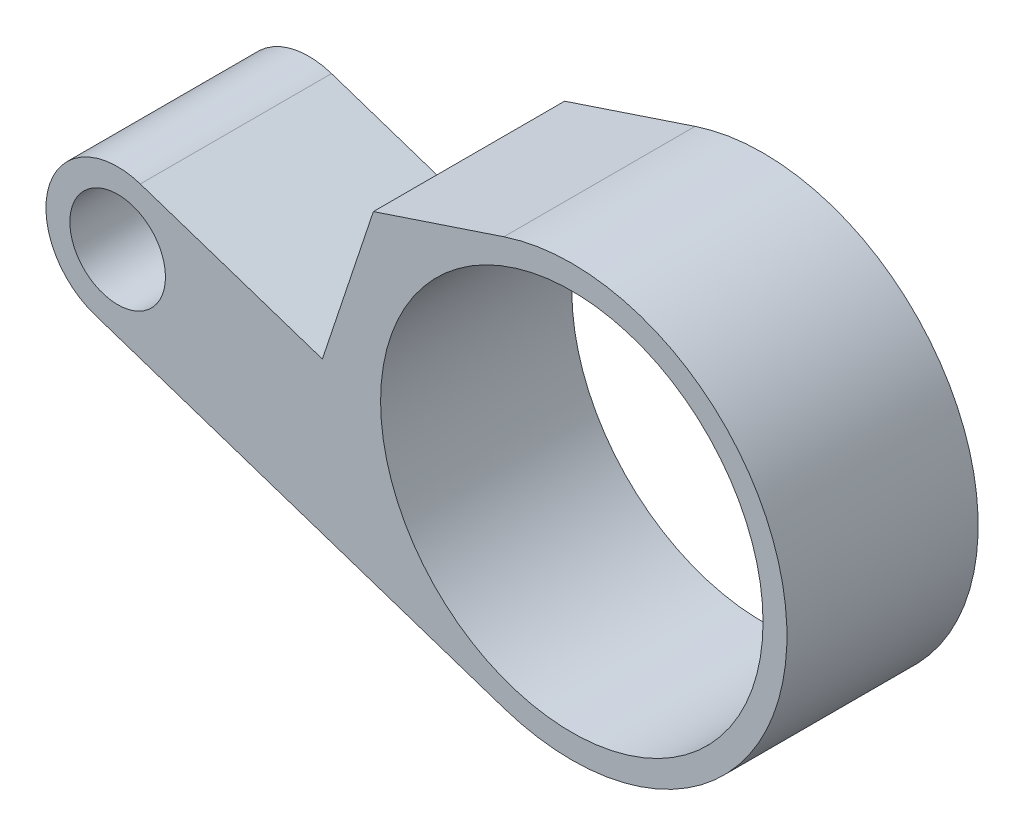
ISO-10303-21;
HEADER;
FILE_DESCRIPTION(('STEP AP214'),'2;1');
FILE_NAME('part.step','',(''),(''),'','','');
FILE_SCHEMA(('AUTOMOTIVE_DESIGN { 1 0 10303 214 1 1 1 1 }'));
ENDSEC;
DATA;
#1=APPLICATION_CONTEXT('core data for automotive mechanical design processes');
#2=APPLICATION_PROTOCOL_DEFINITION('international standard','automotive_design',2000,#1);
#3=PRODUCT_CONTEXT('',#1,'mechanical');
#4=PRODUCT('Part','Part','',(#3));
#5=PRODUCT_RELATED_PRODUCT_CATEGORY('part','',(#4));
#6=PRODUCT_DEFINITION_FORMATION('','',#4);
#7=PRODUCT_DEFINITION_CONTEXT('part definition',#1,'design');
#8=PRODUCT_DEFINITION('design','',#6,#7);
#9=PRODUCT_DEFINITION_SHAPE('','',#8);
#10=(LENGTH_UNIT() NAMED_UNIT(*) SI_UNIT(.MILLI.,.METRE.));
#11=(NAMED_UNIT(*) PLANE_ANGLE_UNIT() SI_UNIT($,.RADIAN.));
#12=(NAMED_UNIT(*) SI_UNIT($,.STERADIAN.) SOLID_ANGLE_UNIT());
#13=UNCERTAINTY_MEASURE_WITH_UNIT(LENGTH_MEASURE(1.E-05),#10,'distance_accuracy_value','');
#14=(GEOMETRIC_REPRESENTATION_CONTEXT(3) GLOBAL_UNCERTAINTY_ASSIGNED_CONTEXT((#13)) GLOBAL_UNIT_ASSIGNED_CONTEXT((#10,
#11,#12)) REPRESENTATION_CONTEXT('',''));
#15=CARTESIAN_POINT('',(0.,0.,0.));
#16=DIRECTION('',(0.,0.,1.));
#17=DIRECTION('',(1.,0.,0.));
#18=AXIS2_PLACEMENT_3D('',#15,#16,#17);
#19=CARTESIAN_POINT('',(-60.325,0.,25.4));
#20=DIRECTION('',(0.,0.,1.));
#21=DIRECTION('',(1.,0.,0.));
#22=AXIS2_PLACEMENT_3D('',#19,#20,#21);
#23=PLANE('',#22);
#24=CARTESIAN_POINT('',(0.,0.,25.4));
#25=DIRECTION('',(0.,0.,1.));
#26=DIRECTION('',(1.,0.,0.));
#27=AXIS2_PLACEMENT_3D('',#24,#25,#26);
#28=CIRCLE('',#27,25.4);
#29=CARTESIAN_POINT('',(25.4,0.,25.4));
#30=VERTEX_POINT('',#29);
#31=EDGE_CURVE('E124',#30,#30,#28,.T.);
#32=ORIENTED_EDGE('',*,*,#31,.F.);
#33=EDGE_LOOP('',(#32));
#34=FACE_BOUND('',#33,.T.);
#35=DIRECTION('',(-0.31578947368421,-0.948829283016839,0.));
#36=VECTOR('',#35,1.);
#37=CARTESIAN_POINT('',(-26.3588028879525,21.3433205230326,25.4));
#38=LINE('',#37,#36);
#39=CARTESIAN_POINT('',(-26.3588028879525,21.3433205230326,25.4));
#40=VERTEX_POINT('',#39);
#41=CARTESIAN_POINT('',(-33.1332244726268,0.988716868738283,25.4));
#42=VERTEX_POINT('',#41);
#43=EDGE_CURVE('E131',#40,#42,#38,.T.);
#44=ORIENTED_EDGE('',*,*,#43,.T.);
#45=DIRECTION('',(-0.948829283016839,0.315789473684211,0.));
#46=VECTOR('',#45,1.);
#47=CARTESIAN_POINT('',(-33.1332244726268,0.988716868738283,25.4));
#48=LINE('',#47,#46);
#49=CARTESIAN_POINT('',(-57.3171052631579,9.03759892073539,25.4));
#50=VERTEX_POINT('',#49);
#51=EDGE_CURVE('E89',#42,#50,#48,.T.);
#52=ORIENTED_EDGE('',*,*,#51,.T.);
#53=CARTESIAN_POINT('',(-60.325,0.,25.4));
#54=DIRECTION('',(0.,0.,1.));
#55=DIRECTION('',(1.,0.,0.));
#56=AXIS2_PLACEMENT_3D('',#53,#54,#55);
#57=CIRCLE('',#56,9.525);
#58=CARTESIAN_POINT('',(-63.3328947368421,-9.0375989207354,25.4));
#59=VERTEX_POINT('',#58);
#60=EDGE_CURVE('E102',#50,#59,#57,.T.);
#61=ORIENTED_EDGE('',*,*,#60,.T.);
#62=DIRECTION('',(0.948829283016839,-0.315789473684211,0.));
#63=VECTOR('',#62,1.);
#64=CARTESIAN_POINT('',(-63.3328947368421,-9.0375989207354,25.4));
#65=LINE('',#64,#63);
#66=CARTESIAN_POINT('',(-9.02368421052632,-27.1127967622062,25.4));
#67=VERTEX_POINT('',#66);
#68=EDGE_CURVE('E96',#59,#67,#65,.T.);
#69=ORIENTED_EDGE('',*,*,#68,.T.);
#70=CARTESIAN_POINT('',(0.,0.,25.4));
#71=DIRECTION('',(0.,0.,1.));
#72=DIRECTION('',(1.,0.,0.));
#73=AXIS2_PLACEMENT_3D('',#70,#71,#72);
#74=CIRCLE('',#73,28.575);
#75=CARTESIAN_POINT('',(-9.02368421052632,27.1127967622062,25.4));
#76=VERTEX_POINT('',#75);
#77=EDGE_CURVE('E100',#67,#76,#74,.T.);
#78=ORIENTED_EDGE('',*,*,#77,.T.);
#79=DIRECTION('',(-0.948829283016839,-0.315789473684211,0.));
#80=VECTOR('',#79,1.);
#81=CARTESIAN_POINT('',(-26.3588028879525,21.3433205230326,25.4));
#82=LINE('',#81,#80);
#83=EDGE_CURVE('E52',#76,#40,#82,.T.);
#84=ORIENTED_EDGE('',*,*,#83,.T.);
#85=EDGE_LOOP('',(#44,#52,#61,#69,#78,#84));
#86=FACE_BOUND('',#85,.T.);
#87=CARTESIAN_POINT('',(-60.325,0.,25.4));
#88=DIRECTION('',(0.,0.,1.));
#89=DIRECTION('',(1.,0.,0.));
#90=AXIS2_PLACEMENT_3D('',#87,#88,#89);
#91=CIRCLE('',#90,6.35);
#92=CARTESIAN_POINT('',(-53.975,0.,25.4));
#93=VERTEX_POINT('',#92);
#94=EDGE_CURVE('E174',#93,#93,#91,.T.);
#95=ORIENTED_EDGE('',*,*,#94,.F.);
#96=EDGE_LOOP('',(#95));
#97=FACE_BOUND('',#96,.T.);
#98=ADVANCED_FACE('F35',(#34,#86,#97),#23,.T.);
#99=CARTESIAN_POINT('',(-60.325,0.,0.));
#100=DIRECTION('',(0.,0.,1.));
#101=DIRECTION('',(1.,0.,0.));
#102=AXIS2_PLACEMENT_3D('',#99,#100,#101);
#103=PLANE('',#102);
#104=CARTESIAN_POINT('',(0.,0.,0.));
#105=DIRECTION('',(0.,0.,1.));
#106=DIRECTION('',(1.,0.,0.));
#107=AXIS2_PLACEMENT_3D('',#104,#105,#106);
#108=CIRCLE('',#107,25.4);
#109=CARTESIAN_POINT('',(25.4,0.,0.));
#110=VERTEX_POINT('',#109);
#111=EDGE_CURVE('E179',#110,#110,#108,.T.);
#112=ORIENTED_EDGE('',*,*,#111,.T.);
#113=EDGE_LOOP('',(#112));
#114=FACE_BOUND('',#113,.T.);
#115=DIRECTION('',(-0.31578947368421,-0.948829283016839,0.));
#116=VECTOR('',#115,1.);
#117=CARTESIAN_POINT('',(-26.3588028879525,21.3433205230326,0.));
#118=LINE('',#117,#116);
#119=CARTESIAN_POINT('',(-26.3588028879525,21.3433205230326,0.));
#120=VERTEX_POINT('',#119);
#121=CARTESIAN_POINT('',(-33.1332244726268,0.988716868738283,0.));
#122=VERTEX_POINT('',#121);
#123=EDGE_CURVE('E120',#120,#122,#118,.T.);
#124=ORIENTED_EDGE('',*,*,#123,.F.);
#125=DIRECTION('',(-0.948829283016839,-0.315789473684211,0.));
#126=VECTOR('',#125,1.);
#127=CARTESIAN_POINT('',(-26.3588028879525,21.3433205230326,0.));
#128=LINE('',#127,#126);
#129=CARTESIAN_POINT('',(-9.02368421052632,27.1127967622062,0.));
#130=VERTEX_POINT('',#129);
#131=EDGE_CURVE('E81',#130,#120,#128,.T.);
#132=ORIENTED_EDGE('',*,*,#131,.F.);
#133=CARTESIAN_POINT('',(0.,0.,0.));
#134=DIRECTION('',(0.,0.,1.));
#135=DIRECTION('',(1.,0.,0.));
#136=AXIS2_PLACEMENT_3D('',#133,#134,#135);
#137=CIRCLE('',#136,28.575);
#138=CARTESIAN_POINT('',(-9.02368421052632,-27.1127967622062,0.));
#139=VERTEX_POINT('',#138);
#140=EDGE_CURVE('E75',#139,#130,#137,.T.);
#141=ORIENTED_EDGE('',*,*,#140,.F.);
#142=DIRECTION('',(0.948829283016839,-0.315789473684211,0.));
#143=VECTOR('',#142,1.);
#144=CARTESIAN_POINT('',(-63.3328947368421,-9.0375989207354,0.));
#145=LINE('',#144,#143);
#146=CARTESIAN_POINT('',(-63.3328947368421,-9.0375989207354,0.));
#147=VERTEX_POINT('',#146);
#148=EDGE_CURVE('E110',#147,#139,#145,.T.);
#149=ORIENTED_EDGE('',*,*,#148,.F.);
#150=CARTESIAN_POINT('',(-60.325,0.,0.));
#151=DIRECTION('',(0.,0.,1.));
#152=DIRECTION('',(1.,0.,0.));
#153=AXIS2_PLACEMENT_3D('',#150,#151,#152);
#154=CIRCLE('',#153,9.525);
#155=CARTESIAN_POINT('',(-57.3171052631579,9.03759892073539,0.));
#156=VERTEX_POINT('',#155);
#157=EDGE_CURVE('E126',#156,#147,#154,.T.);
#158=ORIENTED_EDGE('',*,*,#157,.F.);
#159=DIRECTION('',(-0.948829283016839,0.315789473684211,0.));
#160=VECTOR('',#159,1.);
#161=CARTESIAN_POINT('',(-33.1332244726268,0.988716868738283,0.));
#162=LINE('',#161,#160);
#163=EDGE_CURVE('E123',#122,#156,#162,.T.);
#164=ORIENTED_EDGE('',*,*,#163,.F.);
#165=EDGE_LOOP('',(#124,#132,#141,#149,#158,#164));
#166=FACE_BOUND('',#165,.T.);
#167=CARTESIAN_POINT('',(-60.325,0.,0.));
#168=DIRECTION('',(0.,0.,1.));
#169=DIRECTION('',(1.,0.,0.));
#170=AXIS2_PLACEMENT_3D('',#167,#168,#169);
#171=CIRCLE('',#170,6.35);
#172=CARTESIAN_POINT('',(-53.975,0.,0.));
#173=VERTEX_POINT('',#172);
#174=EDGE_CURVE('E177',#173,#173,#171,.T.);
#175=ORIENTED_EDGE('',*,*,#174,.T.);
#176=EDGE_LOOP('',(#175));
#177=FACE_BOUND('',#176,.T.);
#178=ADVANCED_FACE('F140',(#114,#166,#177),#103,.F.);
#179=CARTESIAN_POINT('',(-26.3588028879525,21.3433205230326,25.4));
#180=DIRECTION('',(0.948829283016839,-0.31578947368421,0.));
#181=DIRECTION('',(0.31578947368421,0.948829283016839,0.));
#182=AXIS2_PLACEMENT_3D('',#179,#180,#181);
#183=PLANE('',#182);
#184=ORIENTED_EDGE('',*,*,#123,.T.);
#185=DIRECTION('',(0.,0.,-1.));
#186=VECTOR('',#185,1.);
#187=CARTESIAN_POINT('',(-33.1332244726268,0.988716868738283,25.4));
#188=LINE('',#187,#186);
#189=EDGE_CURVE('E11',#42,#122,#188,.T.);
#190=ORIENTED_EDGE('',*,*,#189,.F.);
#191=ORIENTED_EDGE('',*,*,#43,.F.);
#192=DIRECTION('',(0.,0.,-1.));
#193=VECTOR('',#192,1.);
#194=CARTESIAN_POINT('',(-26.3588028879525,21.3433205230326,25.4));
#195=LINE('',#194,#193);
#196=EDGE_CURVE('E116',#40,#120,#195,.T.);
#197=ORIENTED_EDGE('',*,*,#196,.T.);
#198=EDGE_LOOP('',(#184,#190,#191,#197));
#199=FACE_BOUND('',#198,.T.);
#200=ADVANCED_FACE('F37',(#199),#183,.F.);
#201=CARTESIAN_POINT('',(-33.1332244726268,0.988716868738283,25.4));
#202=DIRECTION('',(-0.315789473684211,-0.948829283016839,0.));
#203=DIRECTION('',(0.948829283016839,-0.315789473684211,0.));
#204=AXIS2_PLACEMENT_3D('',#201,#202,#203);
#205=PLANE('',#204);
#206=ORIENTED_EDGE('',*,*,#163,.T.);
#207=DIRECTION('',(0.,0.,-1.));
#208=VECTOR('',#207,1.);
#209=CARTESIAN_POINT('',(-57.3171052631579,9.03759892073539,25.4));
#210=LINE('',#209,#208);
#211=EDGE_CURVE('E44',#50,#156,#210,.T.);
#212=ORIENTED_EDGE('',*,*,#211,.F.);
#213=ORIENTED_EDGE('',*,*,#51,.F.);
#214=ORIENTED_EDGE('',*,*,#189,.T.);
#215=EDGE_LOOP('',(#206,#212,#213,#214));
#216=FACE_BOUND('',#215,.T.);
#217=ADVANCED_FACE('F220',(#216),#205,.F.);
#218=CARTESIAN_POINT('',(-60.325,0.,25.4));
#219=DIRECTION('',(0.,0.,-1.));
#220=DIRECTION('',(-1.,0.,0.));
#221=AXIS2_PLACEMENT_3D('',#218,#219,#220);
#222=CYLINDRICAL_SURFACE('',#221,9.525);
#223=ORIENTED_EDGE('',*,*,#157,.T.);
#224=DIRECTION('',(0.,0.,-1.));
#225=VECTOR('',#224,1.);
#226=CARTESIAN_POINT('',(-63.3328947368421,-9.0375989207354,25.4));
#227=LINE('',#226,#225);
#228=EDGE_CURVE('E111',#59,#147,#227,.T.);
#229=ORIENTED_EDGE('',*,*,#228,.F.);
#230=ORIENTED_EDGE('',*,*,#60,.F.);
#231=ORIENTED_EDGE('',*,*,#211,.T.);
#232=EDGE_LOOP('',(#223,#229,#230,#231));
#233=FACE_BOUND('',#232,.T.);
#234=ADVANCED_FACE('F137',(#233),#222,.T.);
#235=CARTESIAN_POINT('',(-63.3328947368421,-9.0375989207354,25.4));
#236=DIRECTION('',(0.315789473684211,0.948829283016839,0.));
#237=DIRECTION('',(-0.948829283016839,0.315789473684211,0.));
#238=AXIS2_PLACEMENT_3D('',#235,#236,#237);
#239=PLANE('',#238);
#240=ORIENTED_EDGE('',*,*,#148,.T.);
#241=DIRECTION('',(0.,0.,-1.));
#242=VECTOR('',#241,1.);
#243=CARTESIAN_POINT('',(-9.02368421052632,-27.1127967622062,25.4));
#244=LINE('',#243,#242);
#245=EDGE_CURVE('E107',#67,#139,#244,.T.);
#246=ORIENTED_EDGE('',*,*,#245,.F.);
#247=ORIENTED_EDGE('',*,*,#68,.F.);
#248=ORIENTED_EDGE('',*,*,#228,.T.);
#249=EDGE_LOOP('',(#240,#246,#247,#248));
#250=FACE_BOUND('',#249,.T.);
#251=ADVANCED_FACE('F108',(#250),#239,.F.);
#252=CARTESIAN_POINT('',(0.,0.,25.4));
#253=DIRECTION('',(0.,0.,-1.));
#254=DIRECTION('',(-1.,0.,0.));
#255=AXIS2_PLACEMENT_3D('',#252,#253,#254);
#256=CYLINDRICAL_SURFACE('',#255,28.575);
#257=ORIENTED_EDGE('',*,*,#140,.T.);
#258=DIRECTION('',(0.,0.,-1.));
#259=VECTOR('',#258,1.);
#260=CARTESIAN_POINT('',(-9.02368421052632,27.1127967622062,25.4));
#261=LINE('',#260,#259);
#262=EDGE_CURVE('E112',#76,#130,#261,.T.);
#263=ORIENTED_EDGE('',*,*,#262,.F.);
#264=ORIENTED_EDGE('',*,*,#77,.F.);
#265=ORIENTED_EDGE('',*,*,#245,.T.);
#266=EDGE_LOOP('',(#257,#263,#264,#265));
#267=FACE_BOUND('',#266,.T.);
#268=ADVANCED_FACE('F114',(#267),#256,.T.);
#269=CARTESIAN_POINT('',(-26.3588028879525,21.3433205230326,25.4));
#270=DIRECTION('',(0.315789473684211,-0.948829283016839,0.));
#271=DIRECTION('',(0.948829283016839,0.315789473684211,0.));
#272=AXIS2_PLACEMENT_3D('',#269,#270,#271);
#273=PLANE('',#272);
#274=ORIENTED_EDGE('',*,*,#131,.T.);
#275=ORIENTED_EDGE('',*,*,#196,.F.);
#276=ORIENTED_EDGE('',*,*,#83,.F.);
#277=ORIENTED_EDGE('',*,*,#262,.T.);
#278=EDGE_LOOP('',(#274,#275,#276,#277));
#279=FACE_BOUND('',#278,.T.);
#280=ADVANCED_FACE('F145',(#279),#273,.F.);
#281=CARTESIAN_POINT('',(0.,0.,25.4));
#282=DIRECTION('',(0.,0.,-1.));
#283=DIRECTION('',(-1.,0.,0.));
#284=AXIS2_PLACEMENT_3D('',#281,#282,#283);
#285=CYLINDRICAL_SURFACE('',#284,25.4);
#286=ORIENTED_EDGE('',*,*,#31,.T.);
#287=EDGE_LOOP('',(#286));
#288=FACE_BOUND('',#287,.T.);
#289=ORIENTED_EDGE('',*,*,#111,.F.);
#290=EDGE_LOOP('',(#289));
#291=FACE_BOUND('',#290,.T.);
#292=ADVANCED_FACE('F147',(#288,#291),#285,.F.);
#293=CARTESIAN_POINT('',(-60.325,0.,25.4));
#294=DIRECTION('',(0.,0.,-1.));
#295=DIRECTION('',(-1.,0.,0.));
#296=AXIS2_PLACEMENT_3D('',#293,#294,#295);
#297=CYLINDRICAL_SURFACE('',#296,6.35);
#298=ORIENTED_EDGE('',*,*,#94,.T.);
#299=EDGE_LOOP('',(#298));
#300=FACE_BOUND('',#299,.T.);
#301=ORIENTED_EDGE('',*,*,#174,.F.);
#302=EDGE_LOOP('',(#301));
#303=FACE_BOUND('',#302,.T.);
#304=ADVANCED_FACE('F153',(#300,#303),#297,.F.);
#305=CLOSED_SHELL('',(#98,#178,#200,#217,#234,#251,#268,#280,#292,#304));
#306=MANIFOLD_SOLID_BREP('B2',#305);
#307=ADVANCED_BREP_SHAPE_REPRESENTATION('',(#18,#306),#14);
#308=SHAPE_DEFINITION_REPRESENTATION(#9,#307);
ENDSEC;
END-ISO-10303-21;
